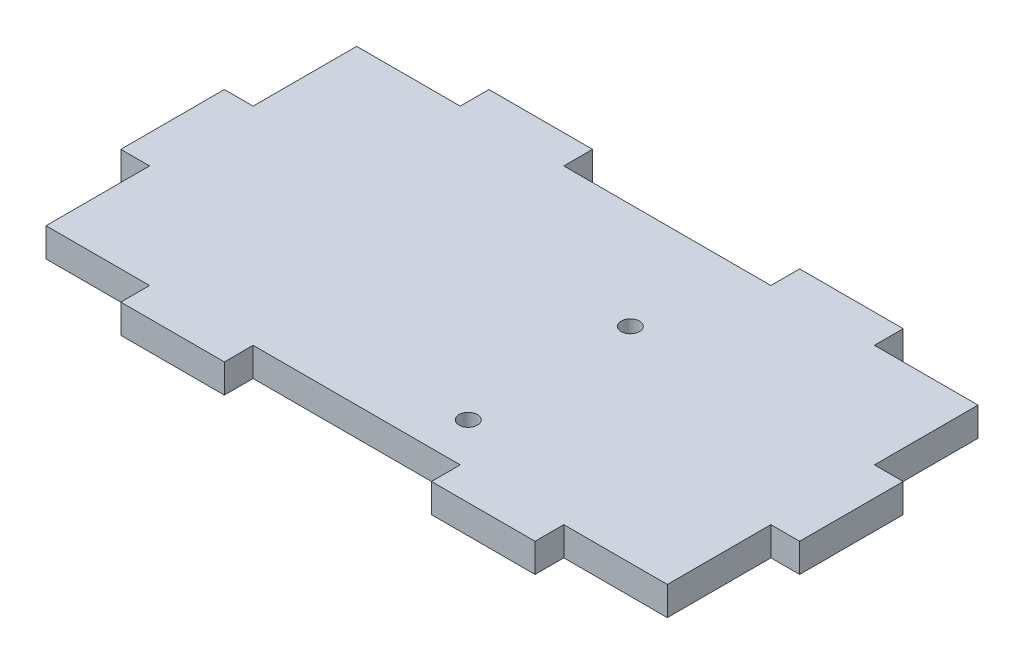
from build123d import *

# Parameters (mm, degrees)
ESQUISSE1_W                 = 108
ESQUISSE1_H                 = 54
BOSS_EXTRU_1_DEPTH          = 5
ESQUISSE2_W                 = 18
ESQUISSE2_H                 = 5
ESQUISSE2_W_2               = 5
ESQUISSE2_H_2               = 9
BOSS_EXTRU_2_DEPTH          = 5
SYM_TRIE2_COPY_1_SKETCH_W   = 18
SYM_TRIE2_COPY_1_SKETCH_H   = 5
SYM_TRIE2_COPY_1_SKETCH_W_2 = 5
SYM_TRIE2_COPY_1_SKETCH_H_2 = 9
SYM_TRIE2_COPY_1_DEPTH      = 5
ESQUISSE3_R                 = 1.588565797
ESQUISSE3_R_2               = 1.6
ENL_V_MAT_EXTRU_1_DEPTH     = 10


with BuildPart() as part:
    # Esquisse1 → Boss.-Extru.1 (new body)
    with BuildSketch(Plane(origin=(0, 0, 0), x_dir=(1, 0, 0), z_dir=(0, 1, 0))):
        Rectangle(ESQUISSE1_W, ESQUISSE1_H)
    extrude(amount=BOSS_EXTRU_1_DEPTH)

    # Esquisse2 → Boss.-Extru.2 (add)
    with BuildSketch(Plane(origin=(0, 5, 0), x_dir=(1, 0, 0), z_dir=(0, 1, 0))):
        with Locations((-27, 29.5)):
            Rectangle(ESQUISSE2_W, ESQUISSE2_H)
        with Locations((-56.5, 4.5)):
            Rectangle(ESQUISSE2_W_2, ESQUISSE2_H_2)
    boss_extru_2 = extrude(amount=-BOSS_EXTRU_2_DEPTH)

    # Sym_trie1: Boss.-Extru.2 across plane
    add(boss_extru_2.mirror(Plane.ZY))

    # Sym_trie2: Boss.-Extru.2 across plane
    add(boss_extru_2.mirror(Plane(origin=(0, 0, 0), x_dir=(1, 0, 0), z_dir=(0, 0, -1))))

    # Sym_trie2 copy 1 sketch → Sym_trie2 copy 1 (add)
    with BuildSketch(Plane(origin=(0, 5, 0), x_dir=(-1, 0, 0), z_dir=(0, 1, 0))):
        with Locations((-27, 29.5)):
            Rectangle(SYM_TRIE2_COPY_1_SKETCH_W, SYM_TRIE2_COPY_1_SKETCH_H)
        with Locations((-56.5, 4.5)):
            Rectangle(SYM_TRIE2_COPY_1_SKETCH_W_2, SYM_TRIE2_COPY_1_SKETCH_H_2)
    extrude(amount=-SYM_TRIE2_COPY_1_DEPTH)

    # Esquisse3 → Enl_v. mat.-Extru.1 (cut)
    with BuildSketch(Plane(origin=(-46.139460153, 5, -68.1634543), x_dir=(1, 0, 0), z_dir=(0, 1, 0))):
        with Locations(Location((58.070487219, -59.518058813, 0), (0, 0, 270))):
            Circle(ESQUISSE3_R)
        with Locations(Location((58.059087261, -87.684669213, 0), (0, 0, 270))):
            Circle(ESQUISSE3_R_2)
    extrude(amount=-ENL_V_MAT_EXTRU_1_DEPTH, mode=Mode.SUBTRACT)


solid = part.part
